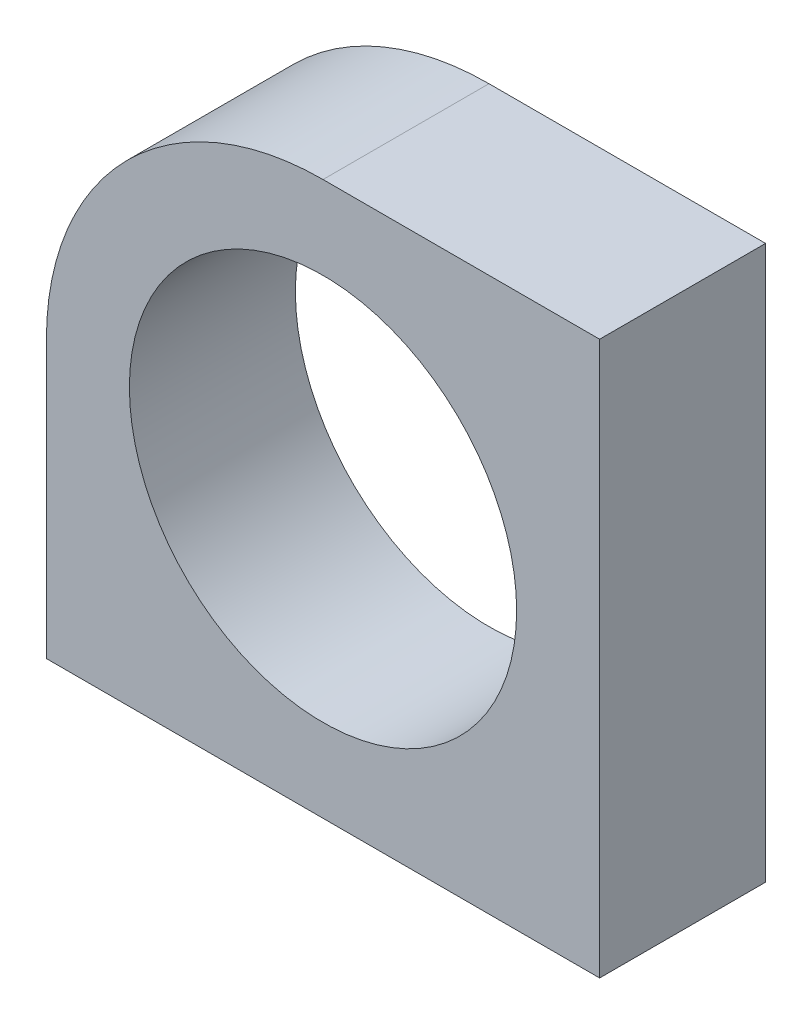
ISO-10303-21;
HEADER;
FILE_DESCRIPTION(('STEP AP214'),'2;1');
FILE_NAME('part.step','',(''),(''),'','','');
FILE_SCHEMA(('AUTOMOTIVE_DESIGN { 1 0 10303 214 1 1 1 1 }'));
ENDSEC;
DATA;
#1=APPLICATION_CONTEXT('core data for automotive mechanical design processes');
#2=APPLICATION_PROTOCOL_DEFINITION('international standard','automotive_design',2000,#1);
#3=PRODUCT_CONTEXT('',#1,'mechanical');
#4=PRODUCT('Part','Part','',(#3));
#5=PRODUCT_RELATED_PRODUCT_CATEGORY('part','',(#4));
#6=PRODUCT_DEFINITION_FORMATION('','',#4);
#7=PRODUCT_DEFINITION_CONTEXT('part definition',#1,'design');
#8=PRODUCT_DEFINITION('design','',#6,#7);
#9=PRODUCT_DEFINITION_SHAPE('','',#8);
#10=(LENGTH_UNIT() NAMED_UNIT(*) SI_UNIT(.MILLI.,.METRE.));
#11=(NAMED_UNIT(*) PLANE_ANGLE_UNIT() SI_UNIT($,.RADIAN.));
#12=(NAMED_UNIT(*) SI_UNIT($,.STERADIAN.) SOLID_ANGLE_UNIT());
#13=UNCERTAINTY_MEASURE_WITH_UNIT(LENGTH_MEASURE(1.E-05),#10,'distance_accuracy_value','');
#14=(GEOMETRIC_REPRESENTATION_CONTEXT(3) GLOBAL_UNCERTAINTY_ASSIGNED_CONTEXT((#13)) GLOBAL_UNIT_ASSIGNED_CONTEXT((#10,
#11,#12)) REPRESENTATION_CONTEXT('',''));
#15=CARTESIAN_POINT('',(0.,0.,0.));
#16=DIRECTION('',(0.,0.,1.));
#17=DIRECTION('',(1.,0.,0.));
#18=AXIS2_PLACEMENT_3D('',#15,#16,#17);
#19=CARTESIAN_POINT('',(0.,0.,3.));
#20=DIRECTION('',(1.,0.,0.));
#21=DIRECTION('',(0.,0.,-1.));
#22=AXIS2_PLACEMENT_3D('',#19,#20,#21);
#23=PLANE('',#22);
#24=DIRECTION('',(0.,-1.,0.));
#25=VECTOR('',#24,1.);
#26=CARTESIAN_POINT('',(0.,0.,3.));
#27=LINE('',#26,#25);
#28=CARTESIAN_POINT('',(0.,5.,3.));
#29=VERTEX_POINT('',#28);
#30=CARTESIAN_POINT('',(0.,0.,3.));
#31=VERTEX_POINT('',#30);
#32=EDGE_CURVE('E93',#29,#31,#27,.T.);
#33=ORIENTED_EDGE('',*,*,#32,.F.);
#34=DIRECTION('',(0.,0.,-1.));
#35=VECTOR('',#34,1.);
#36=CARTESIAN_POINT('',(0.,5.,3.));
#37=LINE('',#36,#35);
#38=CARTESIAN_POINT('',(0.,5.,0.));
#39=VERTEX_POINT('',#38);
#40=EDGE_CURVE('E119',#29,#39,#37,.T.);
#41=ORIENTED_EDGE('',*,*,#40,.T.);
#42=DIRECTION('',(0.,-1.,0.));
#43=VECTOR('',#42,1.);
#44=CARTESIAN_POINT('',(0.,0.,0.));
#45=LINE('',#44,#43);
#46=CARTESIAN_POINT('',(0.,0.,0.));
#47=VERTEX_POINT('',#46);
#48=EDGE_CURVE('E116',#39,#47,#45,.T.);
#49=ORIENTED_EDGE('',*,*,#48,.T.);
#50=DIRECTION('',(0.,0.,-1.));
#51=VECTOR('',#50,1.);
#52=CARTESIAN_POINT('',(0.,0.,3.));
#53=LINE('',#52,#51);
#54=EDGE_CURVE('E109',#31,#47,#53,.T.);
#55=ORIENTED_EDGE('',*,*,#54,.F.);
#56=EDGE_LOOP('',(#33,#41,#49,#55));
#57=FACE_BOUND('',#56,.T.);
#58=ADVANCED_FACE('F45',(#57),#23,.F.);
#59=CARTESIAN_POINT('',(0.,0.,3.));
#60=DIRECTION('',(0.,1.,0.));
#61=DIRECTION('',(0.,0.,1.));
#62=AXIS2_PLACEMENT_3D('',#59,#60,#61);
#63=PLANE('',#62);
#64=DIRECTION('',(1.,0.,0.));
#65=VECTOR('',#64,1.);
#66=CARTESIAN_POINT('',(0.,0.,0.));
#67=LINE('',#66,#65);
#68=CARTESIAN_POINT('',(10.,0.,0.));
#69=VERTEX_POINT('',#68);
#70=EDGE_CURVE('E140',#47,#69,#67,.T.);
#71=ORIENTED_EDGE('',*,*,#70,.T.);
#72=DIRECTION('',(0.,0.,-1.));
#73=VECTOR('',#72,1.);
#74=CARTESIAN_POINT('',(10.,0.,3.));
#75=LINE('',#74,#73);
#76=CARTESIAN_POINT('',(10.,0.,3.));
#77=VERTEX_POINT('',#76);
#78=EDGE_CURVE('E111',#77,#69,#75,.T.);
#79=ORIENTED_EDGE('',*,*,#78,.F.);
#80=DIRECTION('',(1.,0.,0.));
#81=VECTOR('',#80,1.);
#82=CARTESIAN_POINT('',(0.,0.,3.));
#83=LINE('',#82,#81);
#84=EDGE_CURVE('E96',#31,#77,#83,.T.);
#85=ORIENTED_EDGE('',*,*,#84,.F.);
#86=ORIENTED_EDGE('',*,*,#54,.T.);
#87=EDGE_LOOP('',(#71,#79,#85,#86));
#88=FACE_BOUND('',#87,.T.);
#89=ADVANCED_FACE('F108',(#88),#63,.F.);
#90=CARTESIAN_POINT('',(10.,0.,3.));
#91=DIRECTION('',(-1.,0.,0.));
#92=DIRECTION('',(0.,0.,1.));
#93=AXIS2_PLACEMENT_3D('',#90,#91,#92);
#94=PLANE('',#93);
#95=DIRECTION('',(0.,1.,0.));
#96=VECTOR('',#95,1.);
#97=CARTESIAN_POINT('',(10.,0.,0.));
#98=LINE('',#97,#96);
#99=CARTESIAN_POINT('',(10.,10.,0.));
#100=VERTEX_POINT('',#99);
#101=EDGE_CURVE('E137',#69,#100,#98,.T.);
#102=ORIENTED_EDGE('',*,*,#101,.T.);
#103=DIRECTION('',(0.,0.,-1.));
#104=VECTOR('',#103,1.);
#105=CARTESIAN_POINT('',(10.,10.,3.));
#106=LINE('',#105,#104);
#107=CARTESIAN_POINT('',(10.,10.,3.));
#108=VERTEX_POINT('',#107);
#109=EDGE_CURVE('E124',#108,#100,#106,.T.);
#110=ORIENTED_EDGE('',*,*,#109,.F.);
#111=DIRECTION('',(0.,1.,0.));
#112=VECTOR('',#111,1.);
#113=CARTESIAN_POINT('',(10.,0.,3.));
#114=LINE('',#113,#112);
#115=EDGE_CURVE('E114',#77,#108,#114,.T.);
#116=ORIENTED_EDGE('',*,*,#115,.F.);
#117=ORIENTED_EDGE('',*,*,#78,.T.);
#118=EDGE_LOOP('',(#102,#110,#116,#117));
#119=FACE_BOUND('',#118,.T.);
#120=ADVANCED_FACE('F165',(#119),#94,.F.);
#121=CARTESIAN_POINT('',(0.,10.,3.));
#122=DIRECTION('',(0.,-1.,0.));
#123=DIRECTION('',(0.,0.,-1.));
#124=AXIS2_PLACEMENT_3D('',#121,#122,#123);
#125=PLANE('',#124);
#126=DIRECTION('',(-1.,0.,0.));
#127=VECTOR('',#126,1.);
#128=CARTESIAN_POINT('',(0.,10.,0.));
#129=LINE('',#128,#127);
#130=CARTESIAN_POINT('',(5.,10.,0.));
#131=VERTEX_POINT('',#130);
#132=EDGE_CURVE('E104',#100,#131,#129,.T.);
#133=ORIENTED_EDGE('',*,*,#132,.T.);
#134=DIRECTION('',(0.,0.,-1.));
#135=VECTOR('',#134,1.);
#136=CARTESIAN_POINT('',(5.,10.,3.));
#137=LINE('',#136,#135);
#138=CARTESIAN_POINT('',(5.,10.,3.));
#139=VERTEX_POINT('',#138);
#140=EDGE_CURVE('E55',#131,#139,#137,.F.);
#141=ORIENTED_EDGE('',*,*,#140,.T.);
#142=DIRECTION('',(-1.,0.,0.));
#143=VECTOR('',#142,1.);
#144=CARTESIAN_POINT('',(0.,10.,3.));
#145=LINE('',#144,#143);
#146=EDGE_CURVE('E134',#108,#139,#145,.T.);
#147=ORIENTED_EDGE('',*,*,#146,.F.);
#148=ORIENTED_EDGE('',*,*,#109,.T.);
#149=EDGE_LOOP('',(#133,#141,#147,#148));
#150=FACE_BOUND('',#149,.T.);
#151=ADVANCED_FACE('F183',(#150),#125,.F.);
#152=CARTESIAN_POINT('',(0.,0.,3.));
#153=DIRECTION('',(0.,0.,-1.));
#154=DIRECTION('',(-1.,0.,0.));
#155=AXIS2_PLACEMENT_3D('',#152,#153,#154);
#156=PLANE('',#155);
#157=CARTESIAN_POINT('',(5.,5.,3.));
#158=DIRECTION('',(0.,0.,1.));
#159=DIRECTION('',(1.,0.,0.));
#160=AXIS2_PLACEMENT_3D('',#157,#158,#159);
#161=CIRCLE('',#160,3.5);
#162=CARTESIAN_POINT('',(8.5,5.,3.));
#163=VERTEX_POINT('',#162);
#164=EDGE_CURVE('E149',#163,#163,#161,.T.);
#165=ORIENTED_EDGE('',*,*,#164,.F.);
#166=EDGE_LOOP('',(#165));
#167=FACE_BOUND('',#166,.T.);
#168=ORIENTED_EDGE('',*,*,#146,.T.);
#169=CARTESIAN_POINT('',(5.,5.,3.));
#170=DIRECTION('',(0.,0.,-1.));
#171=DIRECTION('',(-1.,0.,0.));
#172=AXIS2_PLACEMENT_3D('',#169,#170,#171);
#173=CIRCLE('',#172,5.);
#174=EDGE_CURVE('E11',#139,#29,#173,.F.);
#175=ORIENTED_EDGE('',*,*,#174,.T.);
#176=ORIENTED_EDGE('',*,*,#32,.T.);
#177=ORIENTED_EDGE('',*,*,#84,.T.);
#178=ORIENTED_EDGE('',*,*,#115,.T.);
#179=EDGE_LOOP('',(#168,#175,#176,#177,#178));
#180=FACE_BOUND('',#179,.T.);
#181=ADVANCED_FACE('F95',(#167,#180),#156,.F.);
#182=CARTESIAN_POINT('',(0.,0.,0.));
#183=DIRECTION('',(0.,0.,-1.));
#184=DIRECTION('',(-1.,0.,0.));
#185=AXIS2_PLACEMENT_3D('',#182,#183,#184);
#186=PLANE('',#185);
#187=CARTESIAN_POINT('',(5.,5.,0.));
#188=DIRECTION('',(0.,0.,-1.));
#189=DIRECTION('',(-1.,0.,0.));
#190=AXIS2_PLACEMENT_3D('',#187,#188,#189);
#191=CIRCLE('',#190,3.5);
#192=CARTESIAN_POINT('',(1.5,5.,0.));
#193=VERTEX_POINT('',#192);
#194=EDGE_CURVE('E49',#193,#193,#191,.T.);
#195=ORIENTED_EDGE('',*,*,#194,.F.);
#196=EDGE_LOOP('',(#195));
#197=FACE_BOUND('',#196,.T.);
#198=ORIENTED_EDGE('',*,*,#48,.F.);
#199=CARTESIAN_POINT('',(5.,5.,0.));
#200=DIRECTION('',(0.,0.,-1.));
#201=DIRECTION('',(-1.,0.,0.));
#202=AXIS2_PLACEMENT_3D('',#199,#200,#201);
#203=CIRCLE('',#202,5.);
#204=EDGE_CURVE('E69',#39,#131,#203,.T.);
#205=ORIENTED_EDGE('',*,*,#204,.T.);
#206=ORIENTED_EDGE('',*,*,#132,.F.);
#207=ORIENTED_EDGE('',*,*,#101,.F.);
#208=ORIENTED_EDGE('',*,*,#70,.F.);
#209=EDGE_LOOP('',(#198,#205,#206,#207,#208));
#210=FACE_BOUND('',#209,.T.);
#211=ADVANCED_FACE('F160',(#197,#210),#186,.T.);
#212=CARTESIAN_POINT('',(5.,5.,3.));
#213=DIRECTION('',(0.,0.,-1.));
#214=DIRECTION('',(-1.,0.,0.));
#215=AXIS2_PLACEMENT_3D('',#212,#213,#214);
#216=CYLINDRICAL_SURFACE('',#215,5.);
#217=ORIENTED_EDGE('',*,*,#174,.F.);
#218=ORIENTED_EDGE('',*,*,#140,.F.);
#219=ORIENTED_EDGE('',*,*,#204,.F.);
#220=ORIENTED_EDGE('',*,*,#40,.F.);
#221=EDGE_LOOP('',(#217,#218,#219,#220));
#222=FACE_BOUND('',#221,.T.);
#223=ADVANCED_FACE('F47',(#222),#216,.T.);
#224=CARTESIAN_POINT('',(5.,5.,-1.));
#225=DIRECTION('',(0.,0.,1.));
#226=DIRECTION('',(1.,0.,0.));
#227=AXIS2_PLACEMENT_3D('',#224,#225,#226);
#228=CYLINDRICAL_SURFACE('',#227,3.5);
#229=ORIENTED_EDGE('',*,*,#194,.T.);
#230=EDGE_LOOP('',(#229));
#231=FACE_BOUND('',#230,.T.);
#232=ORIENTED_EDGE('',*,*,#164,.T.);
#233=EDGE_LOOP('',(#232));
#234=FACE_BOUND('',#233,.T.);
#235=ADVANCED_FACE('F158',(#231,#234),#228,.F.);
#236=CLOSED_SHELL('',(#58,#89,#120,#151,#181,#211,#223,#235));
#237=MANIFOLD_SOLID_BREP('B2',#236);
#238=ADVANCED_BREP_SHAPE_REPRESENTATION('',(#18,#237),#14);
#239=SHAPE_DEFINITION_REPRESENTATION(#9,#238);
ENDSEC;
END-ISO-10303-21;
